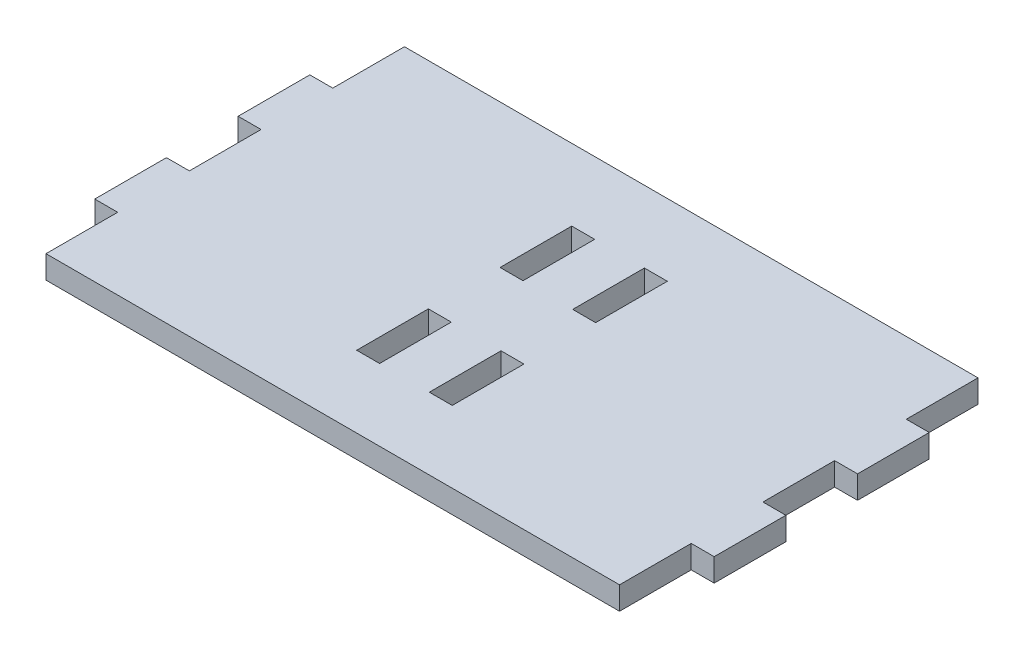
from build123d import *

# Parameters (mm, degrees)
CROQUIS1_W              = 12
CROQUIS1_H              = 37.5
SALIENTE_EXTRUIR1_DEPTH = 12


with BuildPart() as part:
    # Croquis1 → Saliente-Extruir1 (new body)
    with BuildSketch(Plane(origin=(0, 0, 0), x_dir=(1, 0, 0), z_dir=(0, 1, 0))):
        Polygon((-162, 18.75), (-162, 56.25), (-150, 56.25), (-150, 93.75), (150, 93.75), (150, 56.25), (162, 56.25), (162, 18.75), (150, 18.75), (150, -18.75), (162, -18.75), (162, -56.25), (150, -56.25), (150, -93.75), (-150, -93.75), (-150, -56.25), (-162, -56.25), (-162, -18.75), (-150, -18.75), (-150, 18.75), align=None)
        with Locations((-19, -37.5)):
            Rectangle(CROQUIS1_W, CROQUIS1_H, mode=Mode.SUBTRACT)
        with Locations((-19, 37.5)):
            Rectangle(CROQUIS1_W, CROQUIS1_H, mode=Mode.SUBTRACT)
        with Locations((19, -37.5)):
            Rectangle(CROQUIS1_W, CROQUIS1_H, mode=Mode.SUBTRACT)
        with Locations((19, 37.5)):
            Rectangle(CROQUIS1_W, CROQUIS1_H, mode=Mode.SUBTRACT)
    extrude(amount=SALIENTE_EXTRUIR1_DEPTH)


solid = part.part
